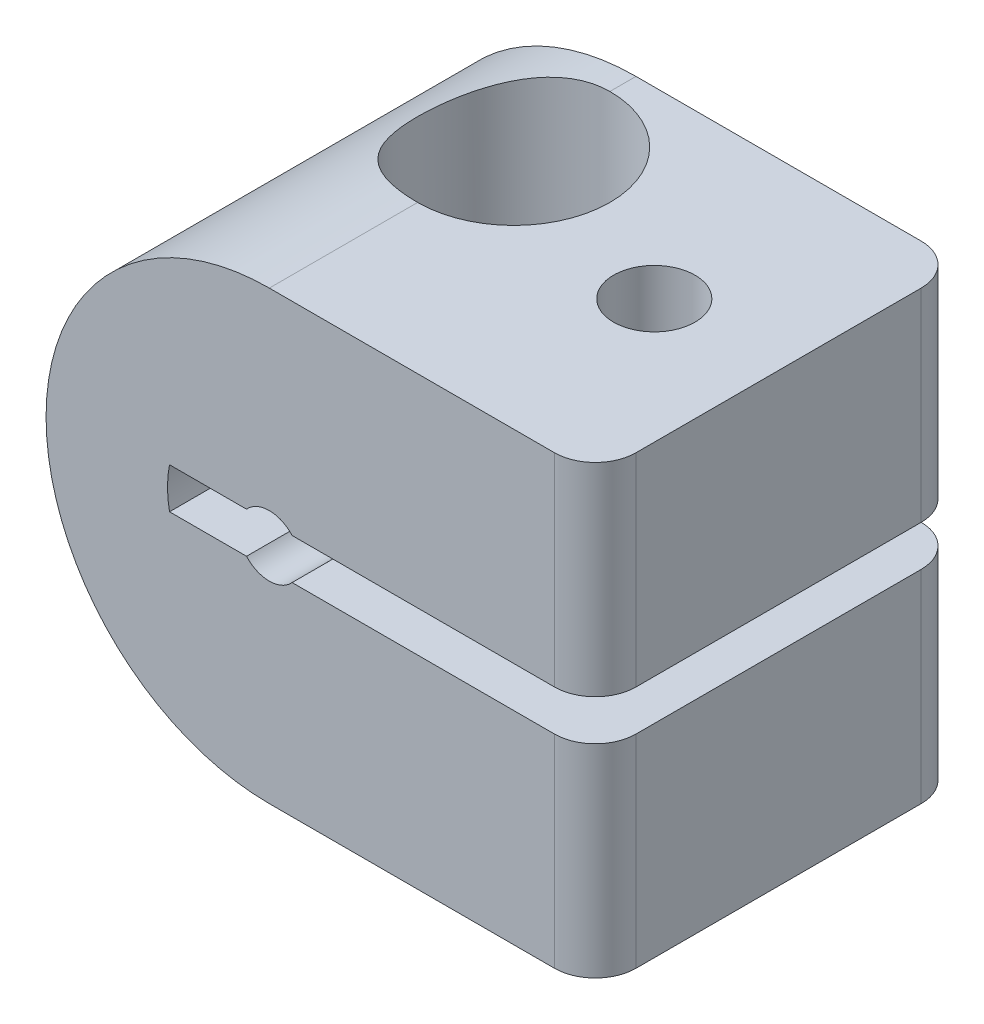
ISO-10303-21;
HEADER;
FILE_DESCRIPTION(('STEP AP214'),'2;1');
FILE_NAME('part.step','',(''),(''),'','','');
FILE_SCHEMA(('AUTOMOTIVE_DESIGN { 1 0 10303 214 1 1 1 1 }'));
ENDSEC;
DATA;
#1=APPLICATION_CONTEXT('core data for automotive mechanical design processes');
#2=APPLICATION_PROTOCOL_DEFINITION('international standard','automotive_design',2000,#1);
#3=PRODUCT_CONTEXT('',#1,'mechanical');
#4=PRODUCT('Part','Part','',(#3));
#5=PRODUCT_RELATED_PRODUCT_CATEGORY('part','',(#4));
#6=PRODUCT_DEFINITION_FORMATION('','',#4);
#7=PRODUCT_DEFINITION_CONTEXT('part definition',#1,'design');
#8=PRODUCT_DEFINITION('design','',#6,#7);
#9=PRODUCT_DEFINITION_SHAPE('','',#8);
#10=(LENGTH_UNIT() NAMED_UNIT(*) SI_UNIT(.MILLI.,.METRE.));
#11=(NAMED_UNIT(*) PLANE_ANGLE_UNIT() SI_UNIT($,.RADIAN.));
#12=(NAMED_UNIT(*) SI_UNIT($,.STERADIAN.) SOLID_ANGLE_UNIT());
#13=UNCERTAINTY_MEASURE_WITH_UNIT(LENGTH_MEASURE(1.E-05),#10,'distance_accuracy_value','');
#14=(GEOMETRIC_REPRESENTATION_CONTEXT(3) GLOBAL_UNCERTAINTY_ASSIGNED_CONTEXT((#13)) GLOBAL_UNIT_ASSIGNED_CONTEXT((#10,
#11,#12)) REPRESENTATION_CONTEXT('',''));
#15=CARTESIAN_POINT('',(0.,0.,0.));
#16=DIRECTION('',(0.,0.,1.));
#17=DIRECTION('',(1.,0.,0.));
#18=AXIS2_PLACEMENT_3D('',#15,#16,#17);
#19=CARTESIAN_POINT('',(0.,0.,-6.35));
#20=DIRECTION('',(0.,0.,-1.));
#21=DIRECTION('',(-1.,0.,0.));
#22=AXIS2_PLACEMENT_3D('',#19,#20,#21);
#23=PLANE('',#22);
#24=DIRECTION('',(0.,-1.,0.));
#25=VECTOR('',#24,1.);
#26=CARTESIAN_POINT('',(8.89,-6.9596,-6.35));
#27=LINE('',#26,#25);
#28=CARTESIAN_POINT('',(8.89,6.9596,-6.35));
#29=VERTEX_POINT('',#28);
#30=CARTESIAN_POINT('',(8.89,0.635,-6.35));
#31=VERTEX_POINT('',#30);
#32=EDGE_CURVE('E208',#29,#31,#27,.T.);
#33=ORIENTED_EDGE('',*,*,#32,.T.);
#34=DIRECTION('',(-1.,0.,0.));
#35=VECTOR('',#34,1.);
#36=CARTESIAN_POINT('',(10.16,0.635,-6.35));
#37=LINE('',#36,#35);
#38=CARTESIAN_POINT('',(3.11085197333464,0.634999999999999,-6.35));
#39=VERTEX_POINT('',#38);
#40=EDGE_CURVE('E307',#31,#39,#37,.T.);
#41=ORIENTED_EDGE('',*,*,#40,.T.);
#42=CARTESIAN_POINT('',(0.,0.,-6.35));
#43=DIRECTION('',(0.,0.,1.));
#44=DIRECTION('',(1.,0.,0.));
#45=AXIS2_PLACEMENT_3D('',#42,#43,#44);
#46=CIRCLE('',#45,3.175);
#47=CARTESIAN_POINT('',(3.11085197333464,-0.635000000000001,-6.35));
#48=VERTEX_POINT('',#47);
#49=EDGE_CURVE('E261',#39,#48,#46,.T.);
#50=ORIENTED_EDGE('',*,*,#49,.T.);
#51=DIRECTION('',(1.,0.,0.));
#52=VECTOR('',#51,1.);
#53=CARTESIAN_POINT('',(10.16,-0.635,-6.35));
#54=LINE('',#53,#52);
#55=CARTESIAN_POINT('',(8.89,-0.635,-6.35));
#56=VERTEX_POINT('',#55);
#57=EDGE_CURVE('E303',#48,#56,#54,.T.);
#58=ORIENTED_EDGE('',*,*,#57,.T.);
#59=CARTESIAN_POINT('',(8.89,-6.9596,-6.35));
#60=VERTEX_POINT('',#59);
#61=EDGE_CURVE('E202',#56,#60,#27,.T.);
#62=ORIENTED_EDGE('',*,*,#61,.T.);
#63=DIRECTION('',(-1.,0.,0.));
#64=VECTOR('',#63,1.);
#65=CARTESIAN_POINT('',(0.,-6.9596,-6.35));
#66=LINE('',#65,#64);
#67=CARTESIAN_POINT('',(0.,-6.9596,-6.35));
#68=VERTEX_POINT('',#67);
#69=EDGE_CURVE('E206',#60,#68,#66,.T.);
#70=ORIENTED_EDGE('',*,*,#69,.T.);
#71=CARTESIAN_POINT('',(0.,0.,-6.35));
#72=DIRECTION('',(0.,0.,-1.));
#73=DIRECTION('',(-1.,0.,0.));
#74=AXIS2_PLACEMENT_3D('',#71,#72,#73);
#75=CIRCLE('',#74,6.9596);
#76=CARTESIAN_POINT('',(0.,6.9596,-6.35));
#77=VERTEX_POINT('',#76);
#78=EDGE_CURVE('E258',#68,#77,#75,.T.);
#79=ORIENTED_EDGE('',*,*,#78,.T.);
#80=DIRECTION('',(1.,0.,0.));
#81=VECTOR('',#80,1.);
#82=CARTESIAN_POINT('',(10.16,6.9596,-6.35));
#83=LINE('',#82,#81);
#84=EDGE_CURVE('E186',#77,#29,#83,.T.);
#85=ORIENTED_EDGE('',*,*,#84,.T.);
#86=EDGE_LOOP('',(#33,#41,#50,#58,#62,#70,#79,#85));
#87=FACE_BOUND('',#86,.T.);
#88=ADVANCED_FACE('F38',(#87),#23,.T.);
#89=CARTESIAN_POINT('',(10.16,6.9596,5.08));
#90=DIRECTION('',(-1.,0.,0.));
#91=DIRECTION('',(0.,0.,1.));
#92=AXIS2_PLACEMENT_3D('',#89,#90,#91);
#93=PLANE('',#92);
#94=DIRECTION('',(0.,0.,-1.));
#95=VECTOR('',#94,1.);
#96=CARTESIAN_POINT('',(10.16,0.635,5.08));
#97=LINE('',#96,#95);
#98=CARTESIAN_POINT('',(10.16,0.635,3.81));
#99=VERTEX_POINT('',#98);
#100=CARTESIAN_POINT('',(10.16,0.635,-5.08));
#101=VERTEX_POINT('',#100);
#102=EDGE_CURVE('E292',#99,#101,#97,.T.);
#103=ORIENTED_EDGE('',*,*,#102,.T.);
#104=DIRECTION('',(0.,-1.,0.));
#105=VECTOR('',#104,1.);
#106=CARTESIAN_POINT('',(10.16,6.9596,-5.08));
#107=LINE('',#106,#105);
#108=CARTESIAN_POINT('',(10.16,6.9596,-5.08));
#109=VERTEX_POINT('',#108);
#110=EDGE_CURVE('E219',#101,#109,#107,.F.);
#111=ORIENTED_EDGE('',*,*,#110,.T.);
#112=DIRECTION('',(0.,0.,-1.));
#113=VECTOR('',#112,1.);
#114=CARTESIAN_POINT('',(10.16,6.9596,5.08));
#115=LINE('',#114,#113);
#116=CARTESIAN_POINT('',(10.16,6.9596,3.81));
#117=VERTEX_POINT('',#116);
#118=EDGE_CURVE('E189',#117,#109,#115,.T.);
#119=ORIENTED_EDGE('',*,*,#118,.F.);
#120=DIRECTION('',(0.,1.,0.));
#121=VECTOR('',#120,1.);
#122=CARTESIAN_POINT('',(10.16,-6.9596,3.81));
#123=LINE('',#122,#121);
#124=EDGE_CURVE('E216',#117,#99,#123,.F.);
#125=ORIENTED_EDGE('',*,*,#124,.T.);
#126=EDGE_LOOP('',(#103,#111,#119,#125));
#127=FACE_BOUND('',#126,.T.);
#128=ADVANCED_FACE('F371',(#127),#93,.F.);
#129=DIRECTION('',(0.,0.,-1.));
#130=VECTOR('',#129,1.);
#131=CARTESIAN_POINT('',(10.16,-0.635,5.08));
#132=LINE('',#131,#130);
#133=CARTESIAN_POINT('',(10.16,-0.635,3.81));
#134=VERTEX_POINT('',#133);
#135=CARTESIAN_POINT('',(10.16,-0.635,-5.08));
#136=VERTEX_POINT('',#135);
#137=EDGE_CURVE('E300',#134,#136,#132,.T.);
#138=ORIENTED_EDGE('',*,*,#137,.F.);
#139=CARTESIAN_POINT('',(10.16,-6.9596,3.81));
#140=VERTEX_POINT('',#139);
#141=EDGE_CURVE('E215',#134,#140,#123,.F.);
#142=ORIENTED_EDGE('',*,*,#141,.T.);
#143=DIRECTION('',(0.,0.,-1.));
#144=VECTOR('',#143,1.);
#145=CARTESIAN_POINT('',(10.16,-6.9596,5.08));
#146=LINE('',#145,#144);
#147=CARTESIAN_POINT('',(10.16,-6.9596,-5.08));
#148=VERTEX_POINT('',#147);
#149=EDGE_CURVE('E196',#140,#148,#146,.T.);
#150=ORIENTED_EDGE('',*,*,#149,.T.);
#151=EDGE_CURVE('E220',#148,#136,#107,.F.);
#152=ORIENTED_EDGE('',*,*,#151,.T.);
#153=EDGE_LOOP('',(#138,#142,#150,#152));
#154=FACE_BOUND('',#153,.T.);
#155=ADVANCED_FACE('F376',(#154),#93,.F.);
#156=CARTESIAN_POINT('',(0.,0.,5.08));
#157=DIRECTION('',(0.,0.,1.));
#158=DIRECTION('',(1.,0.,0.));
#159=AXIS2_PLACEMENT_3D('',#156,#157,#158);
#160=PLANE('',#159);
#161=CARTESIAN_POINT('',(0.,0.,5.08));
#162=DIRECTION('',(0.,0.,1.));
#163=DIRECTION('',(1.,0.,0.));
#164=AXIS2_PLACEMENT_3D('',#161,#162,#163);
#165=CIRCLE('',#164,0.9525);
#166=CARTESIAN_POINT('',(0.709951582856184,0.634999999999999,5.08));
#167=VERTEX_POINT('',#166);
#168=CARTESIAN_POINT('',(-0.709951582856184,0.634999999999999,5.08));
#169=VERTEX_POINT('',#168);
#170=EDGE_CURVE('E251',#167,#169,#165,.T.);
#171=ORIENTED_EDGE('',*,*,#170,.F.);
#172=DIRECTION('',(-1.,0.,0.));
#173=VECTOR('',#172,1.);
#174=CARTESIAN_POINT('',(10.16,0.635,5.08));
#175=LINE('',#174,#173);
#176=CARTESIAN_POINT('',(8.89,0.635,5.08));
#177=VERTEX_POINT('',#176);
#178=EDGE_CURVE('E315',#177,#167,#175,.T.);
#179=ORIENTED_EDGE('',*,*,#178,.F.);
#180=DIRECTION('',(0.,1.,0.));
#181=VECTOR('',#180,1.);
#182=CARTESIAN_POINT('',(8.89,6.9596,5.08));
#183=LINE('',#182,#181);
#184=CARTESIAN_POINT('',(8.89,6.9596,5.08));
#185=VERTEX_POINT('',#184);
#186=EDGE_CURVE('E227',#177,#185,#183,.T.);
#187=ORIENTED_EDGE('',*,*,#186,.T.);
#188=DIRECTION('',(-1.,0.,0.));
#189=VECTOR('',#188,1.);
#190=CARTESIAN_POINT('',(0.,6.9596,5.08));
#191=LINE('',#190,#189);
#192=CARTESIAN_POINT('',(0.,6.9596,5.08));
#193=VERTEX_POINT('',#192);
#194=EDGE_CURVE('E187',#185,#193,#191,.T.);
#195=ORIENTED_EDGE('',*,*,#194,.T.);
#196=CARTESIAN_POINT('',(0.,0.,5.08));
#197=DIRECTION('',(0.,0.,1.));
#198=DIRECTION('',(1.,0.,0.));
#199=AXIS2_PLACEMENT_3D('',#196,#197,#198);
#200=CIRCLE('',#199,6.9596);
#201=CARTESIAN_POINT('',(0.,-6.9596,5.08));
#202=VERTEX_POINT('',#201);
#203=EDGE_CURVE('E248',#193,#202,#200,.T.);
#204=ORIENTED_EDGE('',*,*,#203,.T.);
#205=DIRECTION('',(1.,0.,0.));
#206=VECTOR('',#205,1.);
#207=CARTESIAN_POINT('',(0.,-6.9596,5.08));
#208=LINE('',#207,#206);
#209=CARTESIAN_POINT('',(8.89,-6.9596,5.08));
#210=VERTEX_POINT('',#209);
#211=EDGE_CURVE('E190',#202,#210,#208,.T.);
#212=ORIENTED_EDGE('',*,*,#211,.T.);
#213=CARTESIAN_POINT('',(8.89,-0.635000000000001,5.08));
#214=VERTEX_POINT('',#213);
#215=EDGE_CURVE('E228',#210,#214,#183,.T.);
#216=ORIENTED_EDGE('',*,*,#215,.T.);
#217=DIRECTION('',(1.,0.,0.));
#218=VECTOR('',#217,1.);
#219=CARTESIAN_POINT('',(10.16,-0.635,5.08));
#220=LINE('',#219,#218);
#221=CARTESIAN_POINT('',(0.709951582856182,-0.635000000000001,5.08));
#222=VERTEX_POINT('',#221);
#223=EDGE_CURVE('E245',#222,#214,#220,.T.);
#224=ORIENTED_EDGE('',*,*,#223,.F.);
#225=CARTESIAN_POINT('',(-0.709951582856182,-0.635000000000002,5.08));
#226=VERTEX_POINT('',#225);
#227=EDGE_CURVE('E256',#226,#222,#165,.T.);
#228=ORIENTED_EDGE('',*,*,#227,.F.);
#229=CARTESIAN_POINT('',(-3.11085197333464,-0.635000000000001,5.08));
#230=VERTEX_POINT('',#229);
#231=EDGE_CURVE('E302',#230,#226,#220,.T.);
#232=ORIENTED_EDGE('',*,*,#231,.F.);
#233=CARTESIAN_POINT('',(0.,0.,5.08));
#234=DIRECTION('',(0.,0.,1.));
#235=DIRECTION('',(1.,0.,0.));
#236=AXIS2_PLACEMENT_3D('',#233,#234,#235);
#237=CIRCLE('',#236,3.175);
#238=CARTESIAN_POINT('',(-3.11085197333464,0.634999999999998,5.08));
#239=VERTEX_POINT('',#238);
#240=EDGE_CURVE('E313',#239,#230,#237,.T.);
#241=ORIENTED_EDGE('',*,*,#240,.F.);
#242=EDGE_CURVE('E306',#169,#239,#175,.T.);
#243=ORIENTED_EDGE('',*,*,#242,.F.);
#244=EDGE_LOOP('',(#171,#179,#187,#195,#204,#212,#216,#224,#228,#232,#241,#243));
#245=FACE_BOUND('',#244,.T.);
#246=ADVANCED_FACE('F243',(#245),#160,.T.);
#247=CARTESIAN_POINT('',(0.,0.,-3.81));
#248=DIRECTION('',(0.,0.,1.));
#249=DIRECTION('',(1.,0.,0.));
#250=AXIS2_PLACEMENT_3D('',#247,#248,#249);
#251=CYLINDRICAL_SURFACE('',#250,0.9525);
#252=DIRECTION('',(0.,0.,1.));
#253=VECTOR('',#252,1.);
#254=CARTESIAN_POINT('',(0.709951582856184,0.634999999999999,-3.81));
#255=LINE('',#254,#253);
#256=CARTESIAN_POINT('',(0.709951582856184,0.634999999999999,1.27));
#257=VERTEX_POINT('',#256);
#258=EDGE_CURVE('E270',#167,#257,#255,.F.);
#259=ORIENTED_EDGE('',*,*,#258,.F.);
#260=ORIENTED_EDGE('',*,*,#170,.T.);
#261=DIRECTION('',(0.,0.,1.));
#262=VECTOR('',#261,1.);
#263=CARTESIAN_POINT('',(-0.709951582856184,0.634999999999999,-3.81));
#264=LINE('',#263,#262);
#265=CARTESIAN_POINT('',(-0.709951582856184,0.634999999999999,1.27));
#266=VERTEX_POINT('',#265);
#267=EDGE_CURVE('E264',#266,#169,#264,.T.);
#268=ORIENTED_EDGE('',*,*,#267,.F.);
#269=CARTESIAN_POINT('',(0.,0.,1.27));
#270=DIRECTION('',(0.,0.,1.));
#271=DIRECTION('',(1.,0.,0.));
#272=AXIS2_PLACEMENT_3D('',#269,#270,#271);
#273=CIRCLE('',#272,0.9525);
#274=EDGE_CURVE('E207',#266,#257,#273,.F.);
#275=ORIENTED_EDGE('',*,*,#274,.T.);
#276=EDGE_LOOP('',(#259,#260,#268,#275));
#277=FACE_BOUND('',#276,.T.);
#278=ADVANCED_FACE('F366',(#277),#251,.F.);
#279=DIRECTION('',(0.,0.,1.));
#280=VECTOR('',#279,1.);
#281=CARTESIAN_POINT('',(-0.709951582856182,-0.635000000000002,-3.81));
#282=LINE('',#281,#280);
#283=CARTESIAN_POINT('',(-0.709951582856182,-0.635000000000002,1.27));
#284=VERTEX_POINT('',#283);
#285=EDGE_CURVE('E61',#226,#284,#282,.F.);
#286=ORIENTED_EDGE('',*,*,#285,.F.);
#287=ORIENTED_EDGE('',*,*,#227,.T.);
#288=DIRECTION('',(0.,0.,1.));
#289=VECTOR('',#288,1.);
#290=CARTESIAN_POINT('',(0.709951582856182,-0.635000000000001,-3.81));
#291=LINE('',#290,#289);
#292=CARTESIAN_POINT('',(0.709951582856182,-0.635000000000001,1.27));
#293=VERTEX_POINT('',#292);
#294=EDGE_CURVE('E282',#293,#222,#291,.T.);
#295=ORIENTED_EDGE('',*,*,#294,.F.);
#296=EDGE_CURVE('E203',#293,#284,#273,.F.);
#297=ORIENTED_EDGE('',*,*,#296,.T.);
#298=EDGE_LOOP('',(#286,#287,#295,#297));
#299=FACE_BOUND('',#298,.T.);
#300=ADVANCED_FACE('F359',(#299),#251,.F.);
#301=CARTESIAN_POINT('',(0.,0.,1.27));
#302=DIRECTION('',(0.,0.,1.));
#303=DIRECTION('',(1.,0.,0.));
#304=AXIS2_PLACEMENT_3D('',#301,#302,#303);
#305=PLANE('',#304);
#306=DIRECTION('',(1.,0.,0.));
#307=VECTOR('',#306,1.);
#308=CARTESIAN_POINT('',(0.,0.634999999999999,1.27));
#309=LINE('',#308,#307);
#310=CARTESIAN_POINT('',(-3.11085197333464,0.634999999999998,1.27));
#311=VERTEX_POINT('',#310);
#312=EDGE_CURVE('E269',#311,#266,#309,.T.);
#313=ORIENTED_EDGE('',*,*,#312,.F.);
#314=CARTESIAN_POINT('',(0.,0.,1.27));
#315=DIRECTION('',(0.,0.,1.));
#316=DIRECTION('',(1.,0.,0.));
#317=AXIS2_PLACEMENT_3D('',#314,#315,#316);
#318=CIRCLE('',#317,3.175);
#319=CARTESIAN_POINT('',(3.11085197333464,0.634999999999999,1.27));
#320=VERTEX_POINT('',#319);
#321=EDGE_CURVE('E265',#320,#311,#318,.T.);
#322=ORIENTED_EDGE('',*,*,#321,.F.);
#323=EDGE_CURVE('E272',#257,#320,#309,.T.);
#324=ORIENTED_EDGE('',*,*,#323,.F.);
#325=ORIENTED_EDGE('',*,*,#274,.F.);
#326=EDGE_LOOP('',(#313,#322,#324,#325));
#327=FACE_BOUND('',#326,.T.);
#328=ADVANCED_FACE('F356',(#327),#305,.F.);
#329=DIRECTION('',(-1.,0.,0.));
#330=VECTOR('',#329,1.);
#331=CARTESIAN_POINT('',(0.,-0.635000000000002,1.27));
#332=LINE('',#331,#330);
#333=CARTESIAN_POINT('',(3.11085197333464,-0.635000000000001,1.27));
#334=VERTEX_POINT('',#333);
#335=EDGE_CURVE('E284',#334,#293,#332,.T.);
#336=ORIENTED_EDGE('',*,*,#335,.F.);
#337=CARTESIAN_POINT('',(-3.11085197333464,-0.635000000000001,1.27));
#338=VERTEX_POINT('',#337);
#339=EDGE_CURVE('E263',#338,#334,#318,.T.);
#340=ORIENTED_EDGE('',*,*,#339,.F.);
#341=EDGE_CURVE('E281',#284,#338,#332,.T.);
#342=ORIENTED_EDGE('',*,*,#341,.F.);
#343=ORIENTED_EDGE('',*,*,#296,.F.);
#344=EDGE_LOOP('',(#336,#340,#342,#343));
#345=FACE_BOUND('',#344,.T.);
#346=ADVANCED_FACE('F358',(#345),#305,.F.);
#347=CARTESIAN_POINT('',(0.,0.,1.27));
#348=DIRECTION('',(0.,0.,-1.));
#349=DIRECTION('',(-1.,0.,0.));
#350=AXIS2_PLACEMENT_3D('',#347,#348,#349);
#351=CYLINDRICAL_SURFACE('',#350,3.175);
#352=CARTESIAN_POINT('',(0.,3.175,0.4572));
#353=CARTESIAN_POINT('',(-0.0683138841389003,3.17500103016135,0.457201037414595));
#354=CARTESIAN_POINT('',(-0.136616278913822,3.17278989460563,0.454859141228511));
#355=CARTESIAN_POINT('',(-0.27263085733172,3.16400872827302,0.445554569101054));
#356=CARTESIAN_POINT('',(-0.340342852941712,3.15743735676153,0.438590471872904));
#357=CARTESIAN_POINT('',(-0.54184598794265,3.13134364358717,0.410921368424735));
#358=CARTESIAN_POINT('',(-0.673978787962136,3.10544177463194,0.383439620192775));
#359=CARTESIAN_POINT('',(-0.928841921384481,3.03894311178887,0.312700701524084));
#360=CARTESIAN_POINT('',(-1.05162853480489,2.99844439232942,0.269548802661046));
#361=CARTESIAN_POINT('',(-1.2866719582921,2.90535530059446,0.169978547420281));
#362=CARTESIAN_POINT('',(-1.39892733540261,2.85276328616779,0.113558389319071));
#363=CARTESIAN_POINT('',(-1.65522155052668,2.71474002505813,-0.0353107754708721));
#364=CARTESIAN_POINT('',(-1.79364459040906,2.62464779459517,-0.133084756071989));
#365=CARTESIAN_POINT('',(-2.0476208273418,2.43175215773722,-0.3450121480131));
#366=CARTESIAN_POINT('',(-2.16309809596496,2.3289083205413,-0.459217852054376));
#367=CARTESIAN_POINT('',(-2.33462302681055,2.15392529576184,-0.657632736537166));
#368=CARTESIAN_POINT('',(-2.39722371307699,2.08383082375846,-0.738117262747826));
#369=CARTESIAN_POINT('',(-2.51346203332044,1.94204367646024,-0.904151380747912));
#370=CARTESIAN_POINT('',(-2.56709304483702,1.87034986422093,-0.989704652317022));
#371=CARTESIAN_POINT('',(-2.66543097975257,1.72731498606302,-1.16565456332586));
#372=CARTESIAN_POINT('',(-2.71015853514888,1.65597348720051,-1.25603937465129));
#373=CARTESIAN_POINT('',(-2.79087872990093,1.51594850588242,-1.44248622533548));
#374=CARTESIAN_POINT('',(-2.82688245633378,1.44726174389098,-1.53854086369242));
#375=CARTESIAN_POINT('',(-2.87983708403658,1.33776358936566,-1.70643728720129));
#376=CARTESIAN_POINT('',(-2.89920499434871,1.29503760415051,-1.77625624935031));
#377=CARTESIAN_POINT('',(-2.93338828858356,1.21561084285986,-1.92038300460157));
#378=CARTESIAN_POINT('',(-2.94820750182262,1.17890501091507,-1.9946869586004));
#379=CARTESIAN_POINT('',(-2.96983835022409,1.12311219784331,-2.13144020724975));
#380=CARTESIAN_POINT('',(-2.97769898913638,1.1019213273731,-2.19283408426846));
#381=CARTESIAN_POINT('',(-2.98965681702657,1.06906108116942,-2.31839864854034));
#382=CARTESIAN_POINT('',(-2.99376693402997,1.05735901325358,-2.38255899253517));
#383=CARTESIAN_POINT('',(-2.99778923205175,1.04591343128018,-2.51281666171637));
#384=CARTESIAN_POINT('',(-2.99765806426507,1.04629340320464,-2.57892708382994));
#385=CARTESIAN_POINT('',(-2.99310565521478,1.05923503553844,-2.70983478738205));
#386=CARTESIAN_POINT('',(-2.98867510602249,1.07182312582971,-2.77462890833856));
#387=CARTESIAN_POINT('',(-2.97385417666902,1.11238642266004,-2.9230894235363));
#388=CARTESIAN_POINT('',(-2.96192885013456,1.14418607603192,-3.00549941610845));
#389=CARTESIAN_POINT('',(-2.93248164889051,1.21768286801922,-3.16480173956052));
#390=CARTESIAN_POINT('',(-2.91493450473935,1.25942447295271,-3.24166719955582));
#391=CARTESIAN_POINT('',(-2.87240400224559,1.35385927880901,-3.40026664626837));
#392=CARTESIAN_POINT('',(-2.8467606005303,1.40726991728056,-3.48138572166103));
#393=CARTESIAN_POINT('',(-2.7896113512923,1.51742002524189,-3.63923736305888));
#394=CARTESIAN_POINT('',(-2.75809920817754,1.57416302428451,-3.71596510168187));
#395=CARTESIAN_POINT('',(-2.68926613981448,1.68907321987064,-3.86584266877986));
#396=CARTESIAN_POINT('',(-2.65193704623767,1.74724232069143,-3.9389872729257));
#397=CARTESIAN_POINT('',(-2.57147630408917,1.86363748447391,-4.08189428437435));
#398=CARTESIAN_POINT('',(-2.52834700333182,1.92186351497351,-4.15165804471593));
#399=CARTESIAN_POINT('',(-2.43001199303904,2.04515943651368,-4.29696563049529));
#400=CARTESIAN_POINT('',(-2.37396311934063,2.1101107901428,-4.37204591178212));
#401=CARTESIAN_POINT('',(-2.25405016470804,2.2377614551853,-4.51772106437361));
#402=CARTESIAN_POINT('',(-2.19018358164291,2.30046003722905,-4.58831448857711));
#403=CARTESIAN_POINT('',(-1.98678745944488,2.48321491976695,-4.79224601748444));
#404=CARTESIAN_POINT('',(-1.83503627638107,2.5984874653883,-4.91837778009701));
#405=CARTESIAN_POINT('',(-1.55710783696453,2.76998026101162,-5.10439951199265));
#406=CARTESIAN_POINT('',(-1.44019315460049,2.8328471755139,-5.17212391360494));
#407=CARTESIAN_POINT('',(-1.19296823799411,2.94547102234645,-5.29297520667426));
#408=CARTESIAN_POINT('',(-1.06266520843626,2.99523495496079,-5.34610989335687));
#409=CARTESIAN_POINT('',(-0.858431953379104,3.05759511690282,-5.41254713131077));
#410=CARTESIAN_POINT('',(-0.788487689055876,3.07640210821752,-5.43255376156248));
#411=CARTESIAN_POINT('',(-0.646313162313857,3.10937565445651,-5.4675989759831));
#412=CARTESIAN_POINT('',(-0.574084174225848,3.12354474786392,-5.48264027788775));
#413=CARTESIAN_POINT('',(-0.427966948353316,3.14689332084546,-5.50741259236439));
#414=CARTESIAN_POINT('',(-0.354079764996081,3.15607588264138,-5.51714688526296));
#415=CARTESIAN_POINT('',(-0.205353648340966,3.16923314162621,-5.53109118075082));
#416=CARTESIAN_POINT('',(-0.130514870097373,3.17320867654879,-5.53530207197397));
#417=CARTESIAN_POINT('',(0.0730816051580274,3.17675382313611,-5.5390584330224));
#418=CARTESIAN_POINT('',(0.202110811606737,3.17113680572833,-5.53311117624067));
#419=CARTESIAN_POINT('',(0.456672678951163,3.14459785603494,-5.50497875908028));
#420=CARTESIAN_POINT('',(0.582205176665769,3.1236752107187,-5.48279284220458));
#421=CARTESIAN_POINT('',(0.822935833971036,3.06890839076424,-5.42459277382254));
#422=CARTESIAN_POINT('',(0.938328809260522,3.03545977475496,-5.38900176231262));
#423=CARTESIAN_POINT('',(1.1607179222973,2.95757808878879,-5.30587438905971));
#424=CARTESIAN_POINT('',(1.26771167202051,2.91314190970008,-5.25833464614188));
#425=CARTESIAN_POINT('',(1.51831682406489,2.79327048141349,-5.12954186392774));
#426=CARTESIAN_POINT('',(1.65671764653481,2.71288733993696,-5.04274803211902));
#427=CARTESIAN_POINT('',(1.91281898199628,2.53886558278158,-4.85298039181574));
#428=CARTESIAN_POINT('',(2.03045858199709,2.4451893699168,-4.74996059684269));
#429=CARTESIAN_POINT('',(2.20942957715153,2.28219761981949,-4.56782089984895));
#430=CARTESIAN_POINT('',(2.27647157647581,2.21514916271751,-4.49215612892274));
#431=CARTESIAN_POINT('',(2.40176074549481,2.0786419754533,-4.33577312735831));
#432=CARTESIAN_POINT('',(2.46000298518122,2.00918192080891,-4.2550520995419));
#433=CARTESIAN_POINT('',(2.56783407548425,1.86939442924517,-4.08894634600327));
#434=CARTESIAN_POINT('',(2.61743233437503,1.79906802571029,-4.00356682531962));
#435=CARTESIAN_POINT('',(2.70820679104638,1.6592650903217,-3.82786902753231));
#436=CARTESIAN_POINT('',(2.74938922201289,1.58978796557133,-3.73755446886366));
#437=CARTESIAN_POINT('',(2.81719794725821,1.46566114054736,-3.56645450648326));
#438=CARTESIAN_POINT('',(2.84510570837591,1.41046433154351,-3.4865753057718));
#439=CARTESIAN_POINT('',(2.89481357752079,1.30538298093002,-3.3214750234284));
#440=CARTESIAN_POINT('',(2.91661685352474,1.25549569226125,-3.23625674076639));
#441=CARTESIAN_POINT('',(2.94824863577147,1.17884624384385,-3.08342951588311));
#442=CARTESIAN_POINT('',(2.95972117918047,1.14950747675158,-3.01748969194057));
#443=CARTESIAN_POINT('',(2.97844323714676,1.10009322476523,-2.88167752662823));
#444=CARTESIAN_POINT('',(2.98570657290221,1.07998746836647,-2.81181889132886));
#445=CARTESIAN_POINT('',(2.99430603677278,1.0558854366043,-2.68350202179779));
#446=CARTESIAN_POINT('',(2.99654110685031,1.0494607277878,-2.62558033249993));
#447=CARTESIAN_POINT('',(2.99760602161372,1.04641622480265,-2.50947934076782));
#448=CARTESIAN_POINT('',(2.99643865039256,1.04978841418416,-2.45130028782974));
#449=CARTESIAN_POINT('',(2.99019822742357,1.06744574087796,-2.32344525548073));
#450=CARTESIAN_POINT('',(2.98430276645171,1.08402316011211,-2.25413967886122));
#451=CARTESIAN_POINT('',(2.96828683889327,1.12712514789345,-2.1191010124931));
#452=CARTESIAN_POINT('',(2.95814760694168,1.15369384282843,-2.0533852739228));
#453=CARTESIAN_POINT('',(2.93439831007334,1.21282314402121,-1.92628094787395));
#454=CARTESIAN_POINT('',(2.92082302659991,1.24532284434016,-1.86485643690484));
#455=CARTESIAN_POINT('',(2.89049966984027,1.3141748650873,-1.74498714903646));
#456=CARTESIAN_POINT('',(2.8737482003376,1.35053129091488,-1.68654564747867));
#457=CARTESIAN_POINT('',(2.83722200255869,1.42567463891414,-1.57201241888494));
#458=CARTESIAN_POINT('',(2.81743938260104,1.46446774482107,-1.51592732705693));
#459=CARTESIAN_POINT('',(2.77496411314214,1.5434423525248,-1.40586635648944));
#460=CARTESIAN_POINT('',(2.7522705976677,1.58362426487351,-1.35189111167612));
#461=CARTESIAN_POINT('',(2.68594714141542,1.69502188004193,-1.20609912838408));
#462=CARTESIAN_POINT('',(2.63935307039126,1.76697069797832,-1.11617369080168));
#463=CARTESIAN_POINT('',(2.53724876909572,1.91070430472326,-0.941306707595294));
#464=CARTESIAN_POINT('',(2.48173287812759,1.98248895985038,-0.856368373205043));
#465=CARTESIAN_POINT('',(2.36168156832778,2.12407122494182,-0.691752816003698));
#466=CARTESIAN_POINT('',(2.29716743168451,2.19387306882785,-0.612063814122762));
#467=CARTESIAN_POINT('',(2.15875170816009,2.33020524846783,-0.458245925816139));
#468=CARTESIAN_POINT('',(2.08485130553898,2.39673599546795,-0.384116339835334));
#469=CARTESIAN_POINT('',(1.90024646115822,2.54722174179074,-0.217808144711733));
#470=CARTESIAN_POINT('',(1.78562623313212,2.62929825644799,-0.128192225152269));
#471=CARTESIAN_POINT('',(1.53882122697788,2.78092810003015,0.0362660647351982));
#472=CARTESIAN_POINT('',(1.40665911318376,2.85049731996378,0.111127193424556));
#473=CARTESIAN_POINT('',(1.15122790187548,2.96159906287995,0.230202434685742));
#474=CARTESIAN_POINT('',(1.03062653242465,3.00592308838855,0.277506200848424));
#475=CARTESIAN_POINT('',(0.780388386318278,3.08035042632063,0.356779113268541));
#476=CARTESIAN_POINT('',(0.650768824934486,3.11048002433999,0.388776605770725));
#477=CARTESIAN_POINT('',(0.433551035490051,3.14643944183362,0.426932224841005));
#478=CARTESIAN_POINT('',(0.347611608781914,3.15711176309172,0.438244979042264));
#479=CARTESIAN_POINT('',(0.174442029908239,3.17139200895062,0.453378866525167));
#480=CARTESIAN_POINT('',(0.087211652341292,3.17499868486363,0.457198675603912));
#481=CARTESIAN_POINT('',(0.,3.175,0.4572));
#482=B_SPLINE_CURVE_WITH_KNOTS('',3,(#352,#353,#354,#355,#356,#357,#358,#359,#360,#361,#362,
#363,#364,#365,#366,#367,#368,#369,#370,#371,#372,#373,#374,#375,#376,#377,#378,#379,#380,#381,
#382,#383,#384,#385,#386,#387,#388,#389,#390,#391,#392,#393,#394,#395,#396,#397,#398,#399,#400,
#401,#402,#403,#404,#405,#406,#407,#408,#409,#410,#411,#412,#413,#414,#415,#416,#417,#418,#419,
#420,#421,#422,#423,#424,#425,#426,#427,#428,#429,#430,#431,#432,#433,#434,#435,#436,#437,#438,
#439,#440,#441,#442,#443,#444,#445,#446,#447,#448,#449,#450,#451,#452,#453,#454,#455,#456,#457,
#458,#459,#460,#461,#462,#463,#464,#465,#466,#467,#468,#469,#470,#471,#472,#473,#474,#475,#476,
#477,#478,#479,#480,#481),.UNSPECIFIED.,.T.,.F.,(4,2,2,2,2,2,2,2,2,2,2,2,2,2,2,2,2,2,2,2,2,2,2,
2,2,2,2,2,2,2,2,2,2,2,2,2,2,2,2,2,2,2,2,2,2,2,2,2,2,2,2,2,2,2,2,2,2,2,2,2,2,2,2,2,4),(0.,
0.204838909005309,0.409740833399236,0.819619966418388,1.22679499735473,1.63402535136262,
2.2067019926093,2.78124319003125,3.15204009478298,3.52310956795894,3.89330888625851,
4.26303522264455,4.51509759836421,4.76694718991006,4.96258767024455,5.15755120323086,
5.3545080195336,5.55189219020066,5.81779350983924,6.08490720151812,6.38582469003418,
6.68706686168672,6.98873592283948,7.29028323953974,7.63189482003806,7.97361602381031,
8.6542389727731,9.09984590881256,9.54521429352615,9.77035243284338,9.99536713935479,
10.220242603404,10.4450818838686,10.8307703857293,11.2164768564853,11.5909095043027,
11.9654482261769,12.5086691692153,13.0534583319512,13.4169542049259,13.7806529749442,
14.1439533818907,14.5069837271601,14.8097628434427,15.1123845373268,15.3310963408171,
15.5490858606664,15.723185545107,15.8971428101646,16.1103809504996,16.3245721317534,
16.5366762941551,16.7490085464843,16.9619033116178,17.1748615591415,17.5470995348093,
17.9195746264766,18.2911832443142,18.6627450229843,19.1621167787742,19.6608495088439,
20.0699856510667,20.4783611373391,20.7398187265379,21.0013225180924),.UNSPECIFIED.);
#483=CARTESIAN_POINT('',(0.,3.175,0.4572));
#484=VERTEX_POINT('',#483);
#485=EDGE_CURVE('E181',#484,#484,#482,.T.);
#486=ORIENTED_EDGE('',*,*,#485,.F.);
#487=EDGE_LOOP('',(#486));
#488=FACE_BOUND('',#487,.T.);
#489=ORIENTED_EDGE('',*,*,#339,.T.);
#490=DIRECTION('',(0.,0.,-1.));
#491=VECTOR('',#490,1.);
#492=CARTESIAN_POINT('',(3.11085197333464,-0.635000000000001,1.27));
#493=LINE('',#492,#491);
#494=EDGE_CURVE('E286',#334,#48,#493,.T.);
#495=ORIENTED_EDGE('',*,*,#494,.T.);
#496=ORIENTED_EDGE('',*,*,#49,.F.);
#497=DIRECTION('',(0.,0.,-1.));
#498=VECTOR('',#497,1.);
#499=CARTESIAN_POINT('',(3.11085197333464,0.634999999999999,1.27));
#500=LINE('',#499,#498);
#501=EDGE_CURVE('E274',#39,#320,#500,.F.);
#502=ORIENTED_EDGE('',*,*,#501,.T.);
#503=ORIENTED_EDGE('',*,*,#321,.T.);
#504=DIRECTION('',(0.,0.,-1.));
#505=VECTOR('',#504,1.);
#506=CARTESIAN_POINT('',(-3.11085197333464,0.634999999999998,5.08));
#507=LINE('',#506,#505);
#508=EDGE_CURVE('E295',#239,#311,#507,.T.);
#509=ORIENTED_EDGE('',*,*,#508,.F.);
#510=ORIENTED_EDGE('',*,*,#240,.T.);
#511=DIRECTION('',(0.,0.,-1.));
#512=VECTOR('',#511,1.);
#513=CARTESIAN_POINT('',(-3.11085197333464,-0.635000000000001,5.08));
#514=LINE('',#513,#512);
#515=EDGE_CURVE('E297',#230,#338,#514,.T.);
#516=ORIENTED_EDGE('',*,*,#515,.T.);
#517=EDGE_LOOP('',(#489,#495,#496,#502,#503,#509,#510,#516));
#518=FACE_BOUND('',#517,.T.);
#519=ADVANCED_FACE('F334',(#488,#518),#351,.F.);
#520=CARTESIAN_POINT('',(8.89,0.,-5.08));
#521=DIRECTION('',(0.,1.,0.));
#522=DIRECTION('',(0.,0.,1.));
#523=AXIS2_PLACEMENT_3D('',#520,#521,#522);
#524=CYLINDRICAL_SURFACE('',#523,1.27);
#525=ORIENTED_EDGE('',*,*,#110,.F.);
#526=CARTESIAN_POINT('',(8.89,0.635,-5.08));
#527=DIRECTION('',(0.,-1.,0.));
#528=DIRECTION('',(1.,0.,0.));
#529=AXIS2_PLACEMENT_3D('',#526,#527,#528);
#530=CIRCLE('',#529,1.27);
#531=EDGE_CURVE('E277',#101,#31,#530,.F.);
#532=ORIENTED_EDGE('',*,*,#531,.T.);
#533=ORIENTED_EDGE('',*,*,#32,.F.);
#534=CARTESIAN_POINT('',(8.89,6.9596,-5.08));
#535=DIRECTION('',(0.,-1.,0.));
#536=DIRECTION('',(0.,0.,-1.));
#537=AXIS2_PLACEMENT_3D('',#534,#535,#536);
#538=CIRCLE('',#537,1.27);
#539=EDGE_CURVE('E225',#109,#29,#538,.F.);
#540=ORIENTED_EDGE('',*,*,#539,.F.);
#541=EDGE_LOOP('',(#525,#532,#533,#540));
#542=FACE_BOUND('',#541,.T.);
#543=ADVANCED_FACE('F392',(#542),#524,.T.);
#544=ORIENTED_EDGE('',*,*,#61,.F.);
#545=CARTESIAN_POINT('',(8.89,-0.635,-5.08));
#546=DIRECTION('',(0.,1.,0.));
#547=DIRECTION('',(-1.,0.,0.));
#548=AXIS2_PLACEMENT_3D('',#545,#546,#547);
#549=CIRCLE('',#548,1.27);
#550=EDGE_CURVE('E289',#56,#136,#549,.F.);
#551=ORIENTED_EDGE('',*,*,#550,.T.);
#552=ORIENTED_EDGE('',*,*,#151,.F.);
#553=CARTESIAN_POINT('',(8.89,-6.9596,-5.08));
#554=DIRECTION('',(0.,1.,0.));
#555=DIRECTION('',(0.,0.,1.));
#556=AXIS2_PLACEMENT_3D('',#553,#554,#555);
#557=CIRCLE('',#556,1.27);
#558=EDGE_CURVE('E213',#60,#148,#557,.F.);
#559=ORIENTED_EDGE('',*,*,#558,.F.);
#560=EDGE_LOOP('',(#544,#551,#552,#559));
#561=FACE_BOUND('',#560,.T.);
#562=ADVANCED_FACE('F394',(#561),#524,.T.);
#563=CARTESIAN_POINT('',(8.89,0.,3.81));
#564=DIRECTION('',(0.,-1.,0.));
#565=DIRECTION('',(0.,0.,-1.));
#566=AXIS2_PLACEMENT_3D('',#563,#564,#565);
#567=CYLINDRICAL_SURFACE('',#566,1.27);
#568=ORIENTED_EDGE('',*,*,#186,.F.);
#569=CARTESIAN_POINT('',(8.89,0.635,3.81));
#570=DIRECTION('',(0.,-1.,0.));
#571=DIRECTION('',(1.,0.,0.));
#572=AXIS2_PLACEMENT_3D('',#569,#570,#571);
#573=CIRCLE('',#572,1.27);
#574=EDGE_CURVE('E12',#177,#99,#573,.F.);
#575=ORIENTED_EDGE('',*,*,#574,.T.);
#576=ORIENTED_EDGE('',*,*,#124,.F.);
#577=CARTESIAN_POINT('',(8.89,6.9596,3.81));
#578=DIRECTION('',(0.,-1.,0.));
#579=DIRECTION('',(0.,0.,-1.));
#580=AXIS2_PLACEMENT_3D('',#577,#578,#579);
#581=CIRCLE('',#580,1.27);
#582=EDGE_CURVE('E223',#185,#117,#581,.F.);
#583=ORIENTED_EDGE('',*,*,#582,.F.);
#584=EDGE_LOOP('',(#568,#575,#576,#583));
#585=FACE_BOUND('',#584,.T.);
#586=ADVANCED_FACE('F40',(#585),#567,.T.);
#587=ORIENTED_EDGE('',*,*,#141,.F.);
#588=CARTESIAN_POINT('',(8.89,-0.635,3.81));
#589=DIRECTION('',(0.,1.,0.));
#590=DIRECTION('',(-1.,0.,0.));
#591=AXIS2_PLACEMENT_3D('',#588,#589,#590);
#592=CIRCLE('',#591,1.27);
#593=EDGE_CURVE('E47',#134,#214,#592,.F.);
#594=ORIENTED_EDGE('',*,*,#593,.T.);
#595=ORIENTED_EDGE('',*,*,#215,.F.);
#596=CARTESIAN_POINT('',(8.89,-6.9596,3.81));
#597=DIRECTION('',(0.,1.,0.));
#598=DIRECTION('',(0.,0.,1.));
#599=AXIS2_PLACEMENT_3D('',#596,#597,#598);
#600=CIRCLE('',#599,1.27);
#601=EDGE_CURVE('E211',#140,#210,#600,.F.);
#602=ORIENTED_EDGE('',*,*,#601,.F.);
#603=EDGE_LOOP('',(#587,#594,#595,#602));
#604=FACE_BOUND('',#603,.T.);
#605=ADVANCED_FACE('F235',(#604),#567,.T.);
#606=CARTESIAN_POINT('',(0.,0.,5.08));
#607=DIRECTION('',(0.,0.,-1.));
#608=DIRECTION('',(-1.,0.,0.));
#609=AXIS2_PLACEMENT_3D('',#606,#607,#608);
#610=CYLINDRICAL_SURFACE('',#609,6.9596);
#611=DIRECTION('',(0.,0.,-1.));
#612=VECTOR('',#611,1.);
#613=CARTESIAN_POINT('',(0.,6.9596,5.08));
#614=LINE('',#613,#612);
#615=CARTESIAN_POINT('',(0.,6.9596,0.4572));
#616=VERTEX_POINT('',#615);
#617=EDGE_CURVE('E180',#193,#616,#614,.T.);
#618=ORIENTED_EDGE('',*,*,#617,.T.);
#619=CARTESIAN_POINT('',(0.,6.9596,0.457199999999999));
#620=CARTESIAN_POINT('',(-0.0803834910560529,6.95961273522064,0.457211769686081));
#621=CARTESIAN_POINT('',(-0.160758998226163,6.95820767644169,0.453966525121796));
#622=CARTESIAN_POINT('',(-0.320871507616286,6.95265716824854,0.441053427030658));
#623=CARTESIAN_POINT('',(-0.400608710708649,6.9485126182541,0.431387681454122));
#624=CARTESIAN_POINT('',(-0.5585777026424,6.93759879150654,0.405773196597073));
#625=CARTESIAN_POINT('',(-0.63681402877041,6.93083945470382,0.389848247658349));
#626=CARTESIAN_POINT('',(-0.791518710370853,6.91488169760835,0.351895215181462));
#627=CARTESIAN_POINT('',(-0.867986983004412,6.90568316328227,0.329866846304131));
#628=CARTESIAN_POINT('',(-1.09382934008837,6.87477645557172,0.254965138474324));
#629=CARTESIAN_POINT('',(-1.23991912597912,6.84973675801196,0.193229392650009));
#630=CARTESIAN_POINT('',(-1.51960124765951,6.79317994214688,0.0482251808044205));
#631=CARTESIAN_POINT('',(-1.65318331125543,6.76165756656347,-0.0350607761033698));
#632=CARTESIAN_POINT('',(-1.91119823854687,6.69342885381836,-0.225388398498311));
#633=CARTESIAN_POINT('',(-2.03488758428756,6.65654665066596,-0.333375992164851));
#634=CARTESIAN_POINT('',(-2.26303558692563,6.58248598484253,-0.56802522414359));
#635=CARTESIAN_POINT('',(-2.36748558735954,6.54530739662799,-0.69469522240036));
#636=CARTESIAN_POINT('',(-2.55974571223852,6.47262448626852,-0.971319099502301));
#637=CARTESIAN_POINT('',(-2.64636780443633,6.43731591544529,-1.12215569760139));
#638=CARTESIAN_POINT('',(-2.79267288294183,6.37521564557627,-1.43798958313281));
#639=CARTESIAN_POINT('',(-2.85237123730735,6.34841909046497,-1.60297872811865));
#640=CARTESIAN_POINT('',(-2.9399797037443,6.3083104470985,-1.93378393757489));
#641=CARTESIAN_POINT('',(-2.9693416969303,6.29438622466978,-2.09913827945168));
#642=CARTESIAN_POINT('',(-2.99996708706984,6.27985256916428,-2.43297117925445));
#643=CARTESIAN_POINT('',(-3.00124694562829,6.27923533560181,-2.60144784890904));
#644=CARTESIAN_POINT('',(-2.97675832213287,6.2908717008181,-2.92180318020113));
#645=CARTESIAN_POINT('',(-2.95322491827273,6.30206180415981,-3.0738993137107));
#646=CARTESIAN_POINT('',(-2.88354702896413,6.3342439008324,-3.37172310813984));
#647=CARTESIAN_POINT('',(-2.83739827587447,6.3552377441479,-3.51744956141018));
#648=CARTESIAN_POINT('',(-2.72288862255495,6.40514386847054,-3.80220501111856));
#649=CARTESIAN_POINT('',(-2.65406304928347,6.43421961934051,-3.94101720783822));
#650=CARTESIAN_POINT('',(-2.49648566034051,6.49698205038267,-4.20568776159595));
#651=CARTESIAN_POINT('',(-2.40772538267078,6.5306706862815,-4.33154058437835));
#652=CARTESIAN_POINT('',(-2.20333680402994,6.60258166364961,-4.5787502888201));
#653=CARTESIAN_POINT('',(-2.08600059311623,6.64093790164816,-4.69866109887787));
#654=CARTESIAN_POINT('',(-1.83255162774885,6.71529948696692,-4.9176126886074));
#655=CARTESIAN_POINT('',(-1.69643210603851,6.75130398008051,-5.01664591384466));
#656=CARTESIAN_POINT('',(-1.40442112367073,6.81810454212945,-5.19341806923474));
#657=CARTESIAN_POINT('',(-1.24809937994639,6.84873621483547,-5.27051909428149));
#658=CARTESIAN_POINT('',(-1.00459599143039,6.88720721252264,-5.36517370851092));
#659=CARTESIAN_POINT('',(-0.921938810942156,6.89878352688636,-5.39322292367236));
#660=CARTESIAN_POINT('',(-0.75418385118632,6.91913026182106,-5.44207413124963));
#661=CARTESIAN_POINT('',(-0.669087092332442,6.92790183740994,-5.46287910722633));
#662=CARTESIAN_POINT('',(-0.487362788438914,6.94317752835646,-5.49891927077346));
#663=CARTESIAN_POINT('',(-0.390523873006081,6.94931066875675,-5.5132527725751));
#664=CARTESIAN_POINT('',(-0.19579365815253,6.95753513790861,-5.53240419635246));
#665=CARTESIAN_POINT('',(-0.0979029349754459,6.95962857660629,-5.53722708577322));
#666=CARTESIAN_POINT('',(0.,6.9596,-5.5372));
#667=B_SPLINE_CURVE_WITH_KNOTS('',3,(#619,#620,#621,#622,#623,#624,#625,#626,#627,#628,#629,
#630,#631,#632,#633,#634,#635,#636,#637,#638,#639,#640,#641,#642,#643,#644,#645,#646,#647,#648,
#649,#650,#651,#652,#653,#654,#655,#656,#657,#658,#659,#660,#661,#662,#663,#664,#665,#666),
.UNSPECIFIED.,.F.,.F.,(4,2,2,2,2,2,2,2,2,2,2,2,2,2,2,2,2,2,2,2,2,2,2,4),(0.,0.241059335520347,
0.482039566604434,0.722112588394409,0.96219683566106,1.44152808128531,1.92124959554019,
2.4239230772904,2.92682218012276,3.45660535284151,3.98608574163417,4.48885161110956,
4.99132275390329,5.45210970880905,5.91298365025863,6.38395895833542,6.85513456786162,
7.36909686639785,7.88324482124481,8.41109629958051,8.67493682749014,8.93866856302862,
9.23237227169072,9.52592253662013),.UNSPECIFIED.);
#668=CARTESIAN_POINT('',(0.,6.9596,-5.5372));
#669=VERTEX_POINT('',#668);
#670=EDGE_CURVE('E53',#616,#669,#667,.T.);
#671=ORIENTED_EDGE('',*,*,#670,.T.);
#672=EDGE_CURVE('E177',#669,#77,#614,.T.);
#673=ORIENTED_EDGE('',*,*,#672,.T.);
#674=ORIENTED_EDGE('',*,*,#78,.F.);
#675=DIRECTION('',(0.,0.,-1.));
#676=VECTOR('',#675,1.);
#677=CARTESIAN_POINT('',(0.,-6.9596,5.08));
#678=LINE('',#677,#676);
#679=EDGE_CURVE('E199',#202,#68,#678,.T.);
#680=ORIENTED_EDGE('',*,*,#679,.F.);
#681=ORIENTED_EDGE('',*,*,#203,.F.);
#682=EDGE_LOOP('',(#618,#671,#673,#674,#680,#681));
#683=FACE_BOUND('',#682,.T.);
#684=ADVANCED_FACE('F175',(#683),#610,.T.);
#685=CARTESIAN_POINT('',(0.,-6.9596,5.08));
#686=DIRECTION('',(0.,1.,0.));
#687=DIRECTION('',(0.,0.,1.));
#688=AXIS2_PLACEMENT_3D('',#685,#686,#687);
#689=PLANE('',#688);
#690=CARTESIAN_POINT('',(6.28585197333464,-6.9596,-0.634999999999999));
#691=DIRECTION('',(0.,1.,0.));
#692=DIRECTION('',(0.,0.,1.));
#693=AXIS2_PLACEMENT_3D('',#690,#691,#692);
#694=CIRCLE('',#693,1.27);
#695=CARTESIAN_POINT('',(6.28585197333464,-6.9596,0.635000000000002));
#696=VERTEX_POINT('',#695);
#697=EDGE_CURVE('E322',#696,#696,#694,.T.);
#698=ORIENTED_EDGE('',*,*,#697,.T.);
#699=EDGE_LOOP('',(#698));
#700=FACE_BOUND('',#699,.T.);
#701=ORIENTED_EDGE('',*,*,#69,.F.);
#702=ORIENTED_EDGE('',*,*,#558,.T.);
#703=ORIENTED_EDGE('',*,*,#149,.F.);
#704=ORIENTED_EDGE('',*,*,#601,.T.);
#705=ORIENTED_EDGE('',*,*,#211,.F.);
#706=ORIENTED_EDGE('',*,*,#679,.T.);
#707=EDGE_LOOP('',(#701,#702,#703,#704,#705,#706));
#708=FACE_BOUND('',#707,.T.);
#709=ADVANCED_FACE('F385',(#700,#708),#689,.F.);
#710=CARTESIAN_POINT('',(0.,6.9596,5.08));
#711=DIRECTION('',(0.,-1.,0.));
#712=DIRECTION('',(0.,0.,-1.));
#713=AXIS2_PLACEMENT_3D('',#710,#711,#712);
#714=PLANE('',#713);
#715=CARTESIAN_POINT('',(6.28585197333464,6.9596,-0.634999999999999));
#716=DIRECTION('',(0.,1.,0.));
#717=DIRECTION('',(0.,0.,1.));
#718=AXIS2_PLACEMENT_3D('',#715,#716,#717);
#719=CIRCLE('',#718,1.27);
#720=CARTESIAN_POINT('',(6.28585197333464,6.9596,0.635000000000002));
#721=VERTEX_POINT('',#720);
#722=EDGE_CURVE('E319',#721,#721,#719,.T.);
#723=ORIENTED_EDGE('',*,*,#722,.F.);
#724=EDGE_LOOP('',(#723));
#725=FACE_BOUND('',#724,.T.);
#726=ORIENTED_EDGE('',*,*,#672,.F.);
#727=CARTESIAN_POINT('',(0.,6.9596,-2.54));
#728=DIRECTION('',(0.,1.,0.));
#729=DIRECTION('',(0.,0.,1.));
#730=AXIS2_PLACEMENT_3D('',#727,#728,#729);
#731=CIRCLE('',#730,2.9972);
#732=EDGE_CURVE('E167',#616,#669,#731,.T.);
#733=ORIENTED_EDGE('',*,*,#732,.F.);
#734=ORIENTED_EDGE('',*,*,#617,.F.);
#735=ORIENTED_EDGE('',*,*,#194,.F.);
#736=ORIENTED_EDGE('',*,*,#582,.T.);
#737=ORIENTED_EDGE('',*,*,#118,.T.);
#738=ORIENTED_EDGE('',*,*,#539,.T.);
#739=ORIENTED_EDGE('',*,*,#84,.F.);
#740=EDGE_LOOP('',(#726,#733,#734,#735,#736,#737,#738,#739));
#741=FACE_BOUND('',#740,.T.);
#742=ADVANCED_FACE('F184',(#725,#741),#714,.F.);
#743=CARTESIAN_POINT('',(10.16,-0.635,5.08));
#744=DIRECTION('',(0.,1.,0.));
#745=DIRECTION('',(-1.,0.,0.));
#746=AXIS2_PLACEMENT_3D('',#743,#744,#745);
#747=PLANE('',#746);
#748=CARTESIAN_POINT('',(6.28585197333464,-0.635000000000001,-0.634999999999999));
#749=DIRECTION('',(0.,1.,0.));
#750=DIRECTION('',(-1.,0.,0.));
#751=AXIS2_PLACEMENT_3D('',#748,#749,#750);
#752=CIRCLE('',#751,1.27);
#753=CARTESIAN_POINT('',(6.28585197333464,-0.635000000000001,0.635000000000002));
#754=VERTEX_POINT('',#753);
#755=EDGE_CURVE('E310',#754,#754,#752,.T.);
#756=ORIENTED_EDGE('',*,*,#755,.F.);
#757=EDGE_LOOP('',(#756));
#758=FACE_BOUND('',#757,.T.);
#759=ORIENTED_EDGE('',*,*,#294,.T.);
#760=ORIENTED_EDGE('',*,*,#223,.T.);
#761=ORIENTED_EDGE('',*,*,#593,.F.);
#762=ORIENTED_EDGE('',*,*,#137,.T.);
#763=ORIENTED_EDGE('',*,*,#550,.F.);
#764=ORIENTED_EDGE('',*,*,#57,.F.);
#765=ORIENTED_EDGE('',*,*,#494,.F.);
#766=ORIENTED_EDGE('',*,*,#335,.T.);
#767=EDGE_LOOP('',(#759,#760,#761,#762,#763,#764,#765,#766));
#768=FACE_BOUND('',#767,.T.);
#769=ADVANCED_FACE('F352',(#758,#768),#747,.T.);
#770=CARTESIAN_POINT('',(10.16,0.635,5.08));
#771=DIRECTION('',(0.,-1.,0.));
#772=DIRECTION('',(1.,0.,0.));
#773=AXIS2_PLACEMENT_3D('',#770,#771,#772);
#774=PLANE('',#773);
#775=CARTESIAN_POINT('',(6.28585197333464,0.634999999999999,-0.634999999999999));
#776=DIRECTION('',(0.,-1.,0.));
#777=DIRECTION('',(1.,0.,0.));
#778=AXIS2_PLACEMENT_3D('',#775,#776,#777);
#779=CIRCLE('',#778,1.27);
#780=CARTESIAN_POINT('',(6.28585197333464,0.634999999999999,0.635000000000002));
#781=VERTEX_POINT('',#780);
#782=EDGE_CURVE('E42',#781,#781,#779,.T.);
#783=ORIENTED_EDGE('',*,*,#782,.F.);
#784=EDGE_LOOP('',(#783));
#785=FACE_BOUND('',#784,.T.);
#786=ORIENTED_EDGE('',*,*,#258,.T.);
#787=ORIENTED_EDGE('',*,*,#323,.T.);
#788=ORIENTED_EDGE('',*,*,#501,.F.);
#789=ORIENTED_EDGE('',*,*,#40,.F.);
#790=ORIENTED_EDGE('',*,*,#531,.F.);
#791=ORIENTED_EDGE('',*,*,#102,.F.);
#792=ORIENTED_EDGE('',*,*,#574,.F.);
#793=ORIENTED_EDGE('',*,*,#178,.T.);
#794=EDGE_LOOP('',(#786,#787,#788,#789,#790,#791,#792,#793));
#795=FACE_BOUND('',#794,.T.);
#796=ADVANCED_FACE('F354',(#785,#795),#774,.T.);
#797=ORIENTED_EDGE('',*,*,#267,.T.);
#798=ORIENTED_EDGE('',*,*,#242,.T.);
#799=ORIENTED_EDGE('',*,*,#508,.T.);
#800=ORIENTED_EDGE('',*,*,#312,.T.);
#801=EDGE_LOOP('',(#797,#798,#799,#800));
#802=FACE_BOUND('',#801,.T.);
#803=ADVANCED_FACE('F351',(#802),#774,.T.);
#804=ORIENTED_EDGE('',*,*,#285,.T.);
#805=ORIENTED_EDGE('',*,*,#341,.T.);
#806=ORIENTED_EDGE('',*,*,#515,.F.);
#807=ORIENTED_EDGE('',*,*,#231,.T.);
#808=EDGE_LOOP('',(#804,#805,#806,#807));
#809=FACE_BOUND('',#808,.T.);
#810=ADVANCED_FACE('F347',(#809),#747,.T.);
#811=CARTESIAN_POINT('',(6.28585197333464,-6.9596,-0.634999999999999));
#812=DIRECTION('',(0.,1.,0.));
#813=DIRECTION('',(0.,0.,1.));
#814=AXIS2_PLACEMENT_3D('',#811,#812,#813);
#815=CYLINDRICAL_SURFACE('',#814,1.27);
#816=CARTESIAN_POINT('',(6.28585197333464,0.634999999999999,0.635000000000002));
#817=CARTESIAN_POINT('',(6.28585197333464,0.700881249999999,0.635000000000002));
#818=CARTESIAN_POINT('',(6.28585197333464,0.7667625,0.635000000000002));
#819=CARTESIAN_POINT('',(6.28585197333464,0.898525,0.635000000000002));
#820=CARTESIAN_POINT('',(6.28585197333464,0.964406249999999,0.635000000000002));
#821=CARTESIAN_POINT('',(6.28585197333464,1.09616875,0.635000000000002));
#822=CARTESIAN_POINT('',(6.28585197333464,1.16205,0.635000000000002));
#823=CARTESIAN_POINT('',(6.28585197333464,1.2938125,0.635000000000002));
#824=CARTESIAN_POINT('',(6.28585197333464,1.35969375,0.635000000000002));
#825=CARTESIAN_POINT('',(6.28585197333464,1.49145625,0.635000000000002));
#826=CARTESIAN_POINT('',(6.28585197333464,1.5573375,0.635000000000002));
#827=CARTESIAN_POINT('',(6.28585197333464,1.6891,0.635000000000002));
#828=CARTESIAN_POINT('',(6.28585197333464,1.75498125,0.635000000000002));
#829=CARTESIAN_POINT('',(6.28585197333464,1.88674375,0.635000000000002));
#830=CARTESIAN_POINT('',(6.28585197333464,1.952625,0.635000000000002));
#831=CARTESIAN_POINT('',(6.28585197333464,2.0843875,0.635000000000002));
#832=CARTESIAN_POINT('',(6.28585197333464,2.15026875,0.635000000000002));
#833=CARTESIAN_POINT('',(6.28585197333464,2.28203125,0.635000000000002));
#834=CARTESIAN_POINT('',(6.28585197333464,2.3479125,0.635000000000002));
#835=CARTESIAN_POINT('',(6.28585197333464,2.479675,0.635000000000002));
#836=CARTESIAN_POINT('',(6.28585197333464,2.54555625,0.635000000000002));
#837=CARTESIAN_POINT('',(6.28585197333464,2.67731875,0.635000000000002));
#838=CARTESIAN_POINT('',(6.28585197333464,2.7432,0.635000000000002));
#839=CARTESIAN_POINT('',(6.28585197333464,2.8749625,0.635000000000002));
#840=CARTESIAN_POINT('',(6.28585197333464,2.94084375,0.635000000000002));
#841=CARTESIAN_POINT('',(6.28585197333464,3.07260625,0.635000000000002));
#842=CARTESIAN_POINT('',(6.28585197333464,3.1384875,0.635000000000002));
#843=CARTESIAN_POINT('',(6.28585197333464,3.27025,0.635000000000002));
#844=CARTESIAN_POINT('',(6.28585197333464,3.33613125,0.635000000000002));
#845=CARTESIAN_POINT('',(6.28585197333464,3.46789375,0.635000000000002));
#846=CARTESIAN_POINT('',(6.28585197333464,3.533775,0.635000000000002));
#847=CARTESIAN_POINT('',(6.28585197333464,3.6655375,0.635000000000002));
#848=CARTESIAN_POINT('',(6.28585197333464,3.73141875,0.635000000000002));
#849=CARTESIAN_POINT('',(6.28585197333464,3.86318125,0.635000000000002));
#850=CARTESIAN_POINT('',(6.28585197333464,3.9290625,0.635000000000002));
#851=CARTESIAN_POINT('',(6.28585197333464,4.060825,0.635000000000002));
#852=CARTESIAN_POINT('',(6.28585197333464,4.12670625,0.635000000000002));
#853=CARTESIAN_POINT('',(6.28585197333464,4.25846875,0.635000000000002));
#854=CARTESIAN_POINT('',(6.28585197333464,4.32435,0.635000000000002));
#855=CARTESIAN_POINT('',(6.28585197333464,4.4561125,0.635000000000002));
#856=CARTESIAN_POINT('',(6.28585197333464,4.52199375,0.635000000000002));
#857=CARTESIAN_POINT('',(6.28585197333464,4.65375625,0.635000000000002));
#858=CARTESIAN_POINT('',(6.28585197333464,4.7196375,0.635000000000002));
#859=CARTESIAN_POINT('',(6.28585197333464,4.8514,0.635000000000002));
#860=CARTESIAN_POINT('',(6.28585197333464,4.91728125,0.635000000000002));
#861=CARTESIAN_POINT('',(6.28585197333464,5.04904375,0.635000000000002));
#862=CARTESIAN_POINT('',(6.28585197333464,5.114925,0.635000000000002));
#863=CARTESIAN_POINT('',(6.28585197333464,5.2466875,0.635000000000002));
#864=CARTESIAN_POINT('',(6.28585197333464,5.31256875,0.635000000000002));
#865=CARTESIAN_POINT('',(6.28585197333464,5.44433125,0.635000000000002));
#866=CARTESIAN_POINT('',(6.28585197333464,5.5102125,0.635000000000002));
#867=CARTESIAN_POINT('',(6.28585197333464,5.641975,0.635000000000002));
#868=CARTESIAN_POINT('',(6.28585197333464,5.70785625,0.635000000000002));
#869=CARTESIAN_POINT('',(6.28585197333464,5.83961875,0.635000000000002));
#870=CARTESIAN_POINT('',(6.28585197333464,5.9055,0.635000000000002));
#871=CARTESIAN_POINT('',(6.28585197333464,6.0372625,0.635000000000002));
#872=CARTESIAN_POINT('',(6.28585197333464,6.10314375,0.635000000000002));
#873=CARTESIAN_POINT('',(6.28585197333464,6.23490625,0.635000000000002));
#874=CARTESIAN_POINT('',(6.28585197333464,6.3007875,0.635000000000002));
#875=CARTESIAN_POINT('',(6.28585197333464,6.43255,0.635000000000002));
#876=CARTESIAN_POINT('',(6.28585197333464,6.49843125,0.635000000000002));
#877=CARTESIAN_POINT('',(6.28585197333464,6.63019375,0.635000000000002));
#878=CARTESIAN_POINT('',(6.28585197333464,6.696075,0.635000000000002));
#879=CARTESIAN_POINT('',(6.28585197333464,6.8278375,0.635000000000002));
#880=CARTESIAN_POINT('',(6.28585197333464,6.89371875,0.635000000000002));
#881=CARTESIAN_POINT('',(6.28585197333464,6.9596,0.635000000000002));
#882=B_SPLINE_CURVE_WITH_KNOTS('',3,(#816,#817,#818,#819,#820,#821,#822,#823,#824,#825,#826,
#827,#828,#829,#830,#831,#832,#833,#834,#835,#836,#837,#838,#839,#840,#841,#842,#843,#844,#845,
#846,#847,#848,#849,#850,#851,#852,#853,#854,#855,#856,#857,#858,#859,#860,#861,#862,#863,#864,
#865,#866,#867,#868,#869,#870,#871,#872,#873,#874,#875,#876,#877,#878,#879,#880,#881),
.UNSPECIFIED.,.F.,.F.,(4,2,2,2,2,2,2,2,2,2,2,2,2,2,2,2,2,2,2,2,2,2,2,2,2,2,2,2,2,2,2,2,4),(0.,
0.19764375,0.3952875,0.592931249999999,0.790574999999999,0.988218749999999,1.1858625,1.38350625,
1.58115,1.77879375,1.9764375,2.17408125,2.371725,2.56936875,2.7670125,2.96465625,3.1623,
3.35994375,3.5575875,3.75523125,3.952875,4.15051875,4.3481625,4.54580625,4.74345,4.94109375,
5.1387375,5.33638125,5.534025,5.73166875,5.9293125,6.12695625,6.3246),.UNSPECIFIED.);
#883=EDGE_CURVE('BSEAM343',#781,#721,#882,.T.);
#884=ORIENTED_EDGE('',*,*,#782,.T.);
#885=ORIENTED_EDGE('',*,*,#722,.T.);
#886=ORIENTED_EDGE('',*,*,#883,.T.);
#887=ORIENTED_EDGE('',*,*,#883,.F.);
#888=EDGE_LOOP('',(#884,#886,#885,#887));
#889=FACE_BOUND('',#888,.T.);
#890=ADVANCED_FACE('F343',(#889),#815,.F.);
#891=CARTESIAN_POINT('',(6.28585197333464,-0.635000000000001,0.635000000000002));
#892=CARTESIAN_POINT('',(6.28585197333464,-0.700881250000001,0.635000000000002));
#893=CARTESIAN_POINT('',(6.28585197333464,-0.766762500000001,0.635000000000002));
#894=CARTESIAN_POINT('',(6.28585197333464,-0.898525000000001,0.635000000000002));
#895=CARTESIAN_POINT('',(6.28585197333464,-0.964406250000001,0.635000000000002));
#896=CARTESIAN_POINT('',(6.28585197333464,-1.09616875,0.635000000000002));
#897=CARTESIAN_POINT('',(6.28585197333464,-1.16205,0.635000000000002));
#898=CARTESIAN_POINT('',(6.28585197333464,-1.2938125,0.635000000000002));
#899=CARTESIAN_POINT('',(6.28585197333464,-1.35969375,0.635000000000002));
#900=CARTESIAN_POINT('',(6.28585197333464,-1.49145625,0.635000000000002));
#901=CARTESIAN_POINT('',(6.28585197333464,-1.5573375,0.635000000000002));
#902=CARTESIAN_POINT('',(6.28585197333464,-1.6891,0.635000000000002));
#903=CARTESIAN_POINT('',(6.28585197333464,-1.75498125,0.635000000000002));
#904=CARTESIAN_POINT('',(6.28585197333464,-1.88674375,0.635000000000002));
#905=CARTESIAN_POINT('',(6.28585197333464,-1.952625,0.635000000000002));
#906=CARTESIAN_POINT('',(6.28585197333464,-2.0843875,0.635000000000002));
#907=CARTESIAN_POINT('',(6.28585197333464,-2.15026875,0.635000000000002));
#908=CARTESIAN_POINT('',(6.28585197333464,-2.28203125,0.635000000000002));
#909=CARTESIAN_POINT('',(6.28585197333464,-2.3479125,0.635000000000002));
#910=CARTESIAN_POINT('',(6.28585197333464,-2.479675,0.635000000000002));
#911=CARTESIAN_POINT('',(6.28585197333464,-2.54555625,0.635000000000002));
#912=CARTESIAN_POINT('',(6.28585197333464,-2.67731875,0.635000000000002));
#913=CARTESIAN_POINT('',(6.28585197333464,-2.7432,0.635000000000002));
#914=CARTESIAN_POINT('',(6.28585197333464,-2.8749625,0.635000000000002));
#915=CARTESIAN_POINT('',(6.28585197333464,-2.94084375,0.635000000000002));
#916=CARTESIAN_POINT('',(6.28585197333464,-3.07260625,0.635000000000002));
#917=CARTESIAN_POINT('',(6.28585197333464,-3.1384875,0.635000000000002));
#918=CARTESIAN_POINT('',(6.28585197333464,-3.27025,0.635000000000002));
#919=CARTESIAN_POINT('',(6.28585197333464,-3.33613125,0.635000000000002));
#920=CARTESIAN_POINT('',(6.28585197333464,-3.46789375,0.635000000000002));
#921=CARTESIAN_POINT('',(6.28585197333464,-3.533775,0.635000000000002));
#922=CARTESIAN_POINT('',(6.28585197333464,-3.6655375,0.635000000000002));
#923=CARTESIAN_POINT('',(6.28585197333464,-3.73141875,0.635000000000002));
#924=CARTESIAN_POINT('',(6.28585197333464,-3.86318125,0.635000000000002));
#925=CARTESIAN_POINT('',(6.28585197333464,-3.9290625,0.635000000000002));
#926=CARTESIAN_POINT('',(6.28585197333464,-4.060825,0.635000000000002));
#927=CARTESIAN_POINT('',(6.28585197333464,-4.12670625,0.635000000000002));
#928=CARTESIAN_POINT('',(6.28585197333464,-4.25846875,0.635000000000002));
#929=CARTESIAN_POINT('',(6.28585197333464,-4.32435,0.635000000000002));
#930=CARTESIAN_POINT('',(6.28585197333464,-4.4561125,0.635000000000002));
#931=CARTESIAN_POINT('',(6.28585197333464,-4.52199375,0.635000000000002));
#932=CARTESIAN_POINT('',(6.28585197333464,-4.65375625,0.635000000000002));
#933=CARTESIAN_POINT('',(6.28585197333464,-4.7196375,0.635000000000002));
#934=CARTESIAN_POINT('',(6.28585197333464,-4.8514,0.635000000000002));
#935=CARTESIAN_POINT('',(6.28585197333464,-4.91728125,0.635000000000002));
#936=CARTESIAN_POINT('',(6.28585197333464,-5.04904375,0.635000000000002));
#937=CARTESIAN_POINT('',(6.28585197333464,-5.114925,0.635000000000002));
#938=CARTESIAN_POINT('',(6.28585197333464,-5.2466875,0.635000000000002));
#939=CARTESIAN_POINT('',(6.28585197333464,-5.31256875,0.635000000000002));
#940=CARTESIAN_POINT('',(6.28585197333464,-5.44433125,0.635000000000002));
#941=CARTESIAN_POINT('',(6.28585197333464,-5.5102125,0.635000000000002));
#942=CARTESIAN_POINT('',(6.28585197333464,-5.641975,0.635000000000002));
#943=CARTESIAN_POINT('',(6.28585197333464,-5.70785625,0.635000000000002));
#944=CARTESIAN_POINT('',(6.28585197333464,-5.83961875,0.635000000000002));
#945=CARTESIAN_POINT('',(6.28585197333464,-5.9055,0.635000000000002));
#946=CARTESIAN_POINT('',(6.28585197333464,-6.0372625,0.635000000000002));
#947=CARTESIAN_POINT('',(6.28585197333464,-6.10314375,0.635000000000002));
#948=CARTESIAN_POINT('',(6.28585197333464,-6.23490625,0.635000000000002));
#949=CARTESIAN_POINT('',(6.28585197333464,-6.3007875,0.635000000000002));
#950=CARTESIAN_POINT('',(6.28585197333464,-6.43255,0.635000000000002));
#951=CARTESIAN_POINT('',(6.28585197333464,-6.49843125,0.635000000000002));
#952=CARTESIAN_POINT('',(6.28585197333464,-6.63019375,0.635000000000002));
#953=CARTESIAN_POINT('',(6.28585197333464,-6.696075,0.635000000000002));
#954=CARTESIAN_POINT('',(6.28585197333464,-6.8278375,0.635000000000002));
#955=CARTESIAN_POINT('',(6.28585197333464,-6.89371875,0.635000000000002));
#956=CARTESIAN_POINT('',(6.28585197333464,-6.9596,0.635000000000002));
#957=B_SPLINE_CURVE_WITH_KNOTS('',3,(#891,#892,#893,#894,#895,#896,#897,#898,#899,#900,#901,
#902,#903,#904,#905,#906,#907,#908,#909,#910,#911,#912,#913,#914,#915,#916,#917,#918,#919,#920,
#921,#922,#923,#924,#925,#926,#927,#928,#929,#930,#931,#932,#933,#934,#935,#936,#937,#938,#939,
#940,#941,#942,#943,#944,#945,#946,#947,#948,#949,#950,#951,#952,#953,#954,#955,#956),
.UNSPECIFIED.,.F.,.F.,(4,2,2,2,2,2,2,2,2,2,2,2,2,2,2,2,2,2,2,2,2,2,2,2,2,2,2,2,2,2,2,2,4),(0.,
0.19764375,0.3952875,0.59293125,0.790575,0.98821875,1.1858625,1.38350625,1.58115,1.77879375,
1.9764375,2.17408125,2.371725,2.56936875,2.7670125,2.96465625,3.1623,3.35994375,3.5575875,
3.75523125,3.952875,4.15051875,4.3481625,4.54580625,4.74345,4.94109375,5.1387375,5.33638125,
5.534025,5.73166875,5.9293125,6.12695625,6.3246),.UNSPECIFIED.);
#958=EDGE_CURVE('BSEAM341',#754,#696,#957,.T.);
#959=ORIENTED_EDGE('',*,*,#755,.T.);
#960=ORIENTED_EDGE('',*,*,#697,.F.);
#961=ORIENTED_EDGE('',*,*,#958,.T.);
#962=ORIENTED_EDGE('',*,*,#958,.F.);
#963=EDGE_LOOP('',(#959,#961,#960,#962));
#964=FACE_BOUND('',#963,.T.);
#965=ADVANCED_FACE('F341',(#964),#815,.F.);
#966=CARTESIAN_POINT('',(0.,-8.47736177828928,-2.54));
#967=DIRECTION('',(0.,1.,0.));
#968=DIRECTION('',(0.,0.,1.));
#969=AXIS2_PLACEMENT_3D('',#966,#967,#968);
#970=CYLINDRICAL_SURFACE('',#969,2.9972);
#971=ORIENTED_EDGE('',*,*,#485,.T.);
#972=EDGE_LOOP('',(#971));
#973=FACE_BOUND('',#972,.T.);
#974=ORIENTED_EDGE('',*,*,#732,.T.);
#975=ORIENTED_EDGE('',*,*,#670,.F.);
#976=EDGE_LOOP('',(#974,#975));
#977=FACE_BOUND('',#976,.T.);
#978=ADVANCED_FACE('F168',(#973,#977),#970,.F.);
#979=CLOSED_SHELL('',(#88,#128,#155,#246,#278,#300,#328,#346,#519,#543,#562,#586,#605,#684,#709,
#742,#769,#796,#803,#810,#890,#965,#978));
#980=MANIFOLD_SOLID_BREP('B2',#979);
#981=ADVANCED_BREP_SHAPE_REPRESENTATION('',(#18,#980),#14);
#982=SHAPE_DEFINITION_REPRESENTATION(#9,#981);
ENDSEC;
END-ISO-10303-21;
